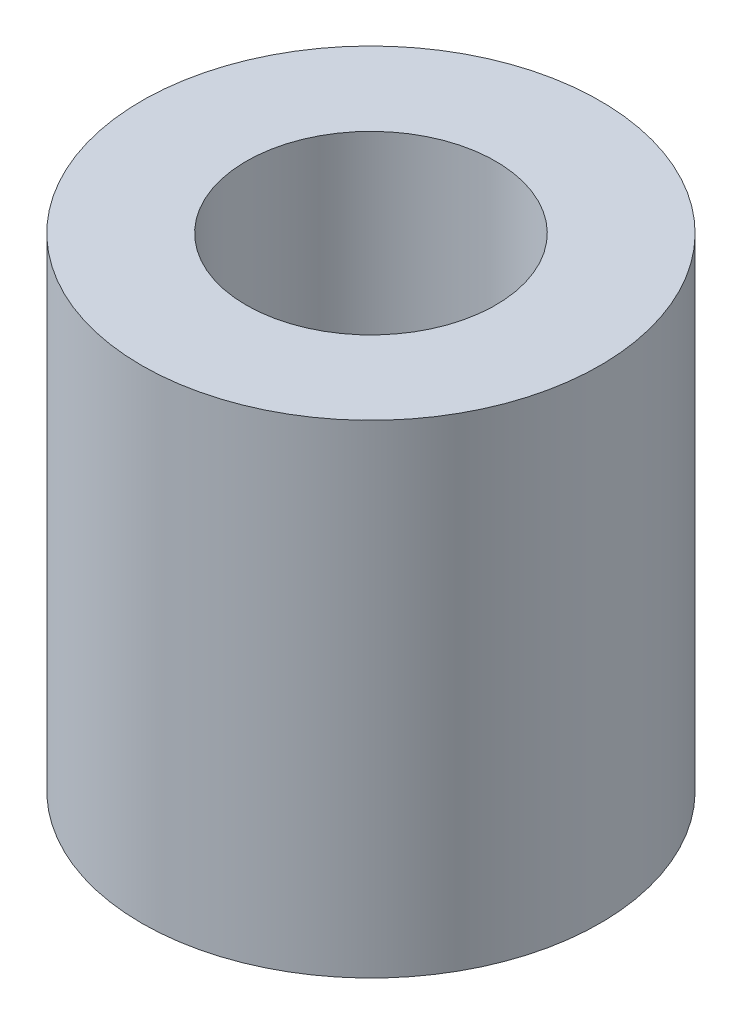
from build123d import *

# Parameters (mm, degrees)
SKETCH1_R             = 3.175
EXTRUDE1_DEPTH        = 7.14375
CHAMFER1_SIZE         = 0.453571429
CHAMFER1_SIZE2        = 0.785608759
F_8_32_TAPPED_HOLE1_D = 3.4544


with BuildPart() as part:
    # Sketch1 → Extrude1 (new body)
    with BuildSketch(Plane(origin=(0, 0, 0), x_dir=(1, 0, 0), z_dir=(0, 1, 0))):
        with Locations(Location((0, 0, 0), (0, 0, 270))):
            Circle(SKETCH1_R)
    extrude(amount=-EXTRUDE1_DEPTH)

    # Chamfer1
    chamfer1_edges = [part.edges().sort_by_distance(p)[0] for p in [
        (0, -7.14375, -3.175),
    ]]
    chamfer1_side = [part.faces().sort_by_distance(p)[0] for p in [
        (0, -3.571875, -3.175),
    ]]
    chamfer(chamfer1_edges, length=CHAMFER1_SIZE, length2=CHAMFER1_SIZE2, reference=chamfer1_side[0])

    # 8-32 Tapped Hole1 (through all)
    with Locations(Plane(origin=(0, 0, 0), x_dir=(-1, 0, 0), z_dir=(0, 1, 0))):
        with Locations((0, 0)):
            Hole(F_8_32_TAPPED_HOLE1_D / 2)


solid = part.part
